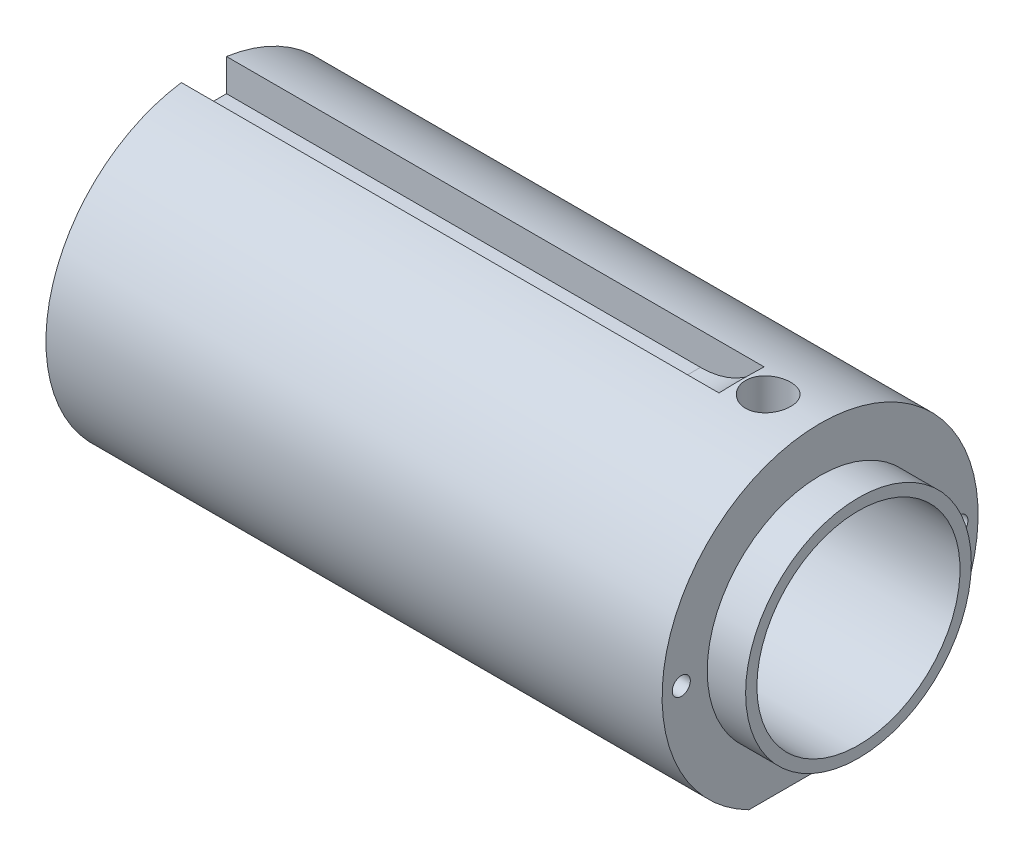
from build123d import *

# Parameters (mm, degrees)
PER_AGE1_REACH                 = 60.992
PER_AGE1_BORE_R                = 2
ENL_V_MAT_EXTRU_1_DEPTH        = 2
ENL_V_MAT_EXTRU_1_DEPTH_BACK   = 2
ESQUISSE4_W                    = 27.898660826
ESQUISSE4_H                    = 7.405459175
ENL_V_MAT_EXTRU_3_DEPTH        = 62.286213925
TROU_TARAUD_M6X1_02_REACH      = 67.286
TROU_TARAUD_M6X1_02_BORE_R     = 3
TROU_TARAUD_M2X0_41_AT_2_COUNT = 2
TROU_TARAUD_M2X0_41_AT_2_PITCH = 24.6


with BuildPart() as part:
    # Esquisse1 → Base-R_volution (revolve)
    with BuildSketch(Plane.XY, mode=Mode.PRIVATE) as base_r_volution_sk:
        Polygon((0, 9.1), (0, 14), (54.6, 14), (54.6, 10), (58, 10), (58, 9), (14, 9), (14, 9.1), align=None)
    revolve(base_r_volution_sk.sketch.rotate(Axis((0, 0, 0), (1, 0, 0)), 90), axis=Axis((0, 0, 0), (1, 0, 0)))

    # Per_age1 bore (on position points) → Per_age1 (cut, up to next)
    with BuildSketch(Plane(origin=(50, 14, 0), x_dir=(0, 0, 1), z_dir=(0, 1, 0)), mode=Mode.PRIVATE) as per_age1_sk1:
        Circle(PER_AGE1_BORE_R)
    per_age1_tool1 = extrude(per_age1_sk1.sketch, amount=-PER_AGE1_REACH, mode=Mode.PRIVATE) & part.part
    add(per_age1_tool1.solids().sort_by_distance((50, 14, 0))[0], mode=Mode.SUBTRACT)

    # Esquisse3 → Enl_v. mat.-Extru.1 (cut, two sides: drawn at the far end of the back side and taken through both)
    with BuildSketch(Plane.XY.offset(-ENL_V_MAT_EXTRU_1_DEPTH_BACK)):
        with BuildLine():
            Line((49, 18.50834461), (-3.459855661, 18.50834461))
            Line((-3.459855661, 18.50834461), (-3.459855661, 11))
            Line((-3.459855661, 11), (42, 11))
            ThreePointArc((42, 11), (46.949747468, 13.050252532), (49, 18))
            Line((49, 18), (49, 18.50834461))
        make_face()
    extrude(amount=ENL_V_MAT_EXTRU_1_DEPTH + ENL_V_MAT_EXTRU_1_DEPTH_BACK, mode=Mode.SUBTRACT)

    # Esquisse4 → Enl_v. mat.-Extru.3 (cut, through all)
    with BuildSketch(Plane.ZY):
        with Locations((-0.117007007, -16.202729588)):
            Rectangle(ESQUISSE4_W, ESQUISSE4_H)
    extrude(amount=-ENL_V_MAT_EXTRU_3_DEPTH, mode=Mode.SUBTRACT)

    # Trou taraud_ M6x1.02 bore → Trou taraud_ M6x1.02 (cut, up to next)
    with BuildSketch(Plane.XZ.offset(12.5), mode=Mode.PRIVATE) as trou_taraud_m6x1_02_sk1:
        with Locations((18, 0)):
            Circle(TROU_TARAUD_M6X1_02_BORE_R)
    trou_taraud_m6x1_02_tool1 = extrude(trou_taraud_m6x1_02_sk1.sketch, amount=-TROU_TARAUD_M6X1_02_REACH, mode=Mode.PRIVATE) & part.part
    add(trou_taraud_m6x1_02_tool1.solids().sort_by_distance((18, -12.5, 0))[0], mode=Mode.SUBTRACT)

    # Esquisse11 → Trou taraud_ M2x0.41 (revolve, cut)
    with BuildSketch(Plane(origin=(54.6, 0, -12.3), x_dir=(0, 0, -1), z_dir=(0, 1, 0))):
        Polygon((0, 0), (0, 6.480688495), (0.8, 6), (0.8, 0), align=None)
    trou_taraud_m2x0_41 = revolve(axis=Axis((60.95, 0, -12.3), (-1, 0, 0)), mode=Mode.SUBTRACT)

    # Trou taraud_ M2x0.41 at 2: Trou taraud_ M2x0.41 ×2
    with Locations(*[(0, 0, i * TROU_TARAUD_M2X0_41_AT_2_PITCH) for i in range(1, TROU_TARAUD_M2X0_41_AT_2_COUNT)]):
        add(trou_taraud_m2x0_41, mode=Mode.SUBTRACT)


solid = part.part
